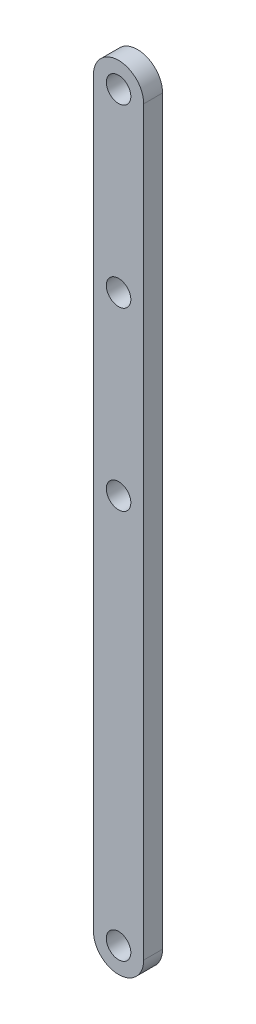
ISO-10303-21;
HEADER;
FILE_DESCRIPTION(('STEP AP214'),'2;1');
FILE_NAME('part.step','',(''),(''),'','','');
FILE_SCHEMA(('AUTOMOTIVE_DESIGN { 1 0 10303 214 1 1 1 1 }'));
ENDSEC;
DATA;
#1=APPLICATION_CONTEXT('core data for automotive mechanical design processes');
#2=APPLICATION_PROTOCOL_DEFINITION('international standard','automotive_design',2000,#1);
#3=PRODUCT_CONTEXT('',#1,'mechanical');
#4=PRODUCT('Part','Part','',(#3));
#5=PRODUCT_RELATED_PRODUCT_CATEGORY('part','',(#4));
#6=PRODUCT_DEFINITION_FORMATION('','',#4);
#7=PRODUCT_DEFINITION_CONTEXT('part definition',#1,'design');
#8=PRODUCT_DEFINITION('design','',#6,#7);
#9=PRODUCT_DEFINITION_SHAPE('','',#8);
#10=(LENGTH_UNIT() NAMED_UNIT(*) SI_UNIT(.MILLI.,.METRE.));
#11=(NAMED_UNIT(*) PLANE_ANGLE_UNIT() SI_UNIT($,.RADIAN.));
#12=(NAMED_UNIT(*) SI_UNIT($,.STERADIAN.) SOLID_ANGLE_UNIT());
#13=UNCERTAINTY_MEASURE_WITH_UNIT(LENGTH_MEASURE(1.E-05),#10,'distance_accuracy_value','');
#14=(GEOMETRIC_REPRESENTATION_CONTEXT(3) GLOBAL_UNCERTAINTY_ASSIGNED_CONTEXT((#13)) GLOBAL_UNIT_ASSIGNED_CONTEXT((#10,
#11,#12)) REPRESENTATION_CONTEXT('',''));
#15=CARTESIAN_POINT('',(0.,0.,0.));
#16=DIRECTION('',(0.,0.,1.));
#17=DIRECTION('',(1.,0.,0.));
#18=AXIS2_PLACEMENT_3D('',#15,#16,#17);
#19=CARTESIAN_POINT('',(0.,0.,3.));
#20=DIRECTION('',(0.,0.,-1.));
#21=DIRECTION('',(-1.,0.,0.));
#22=AXIS2_PLACEMENT_3D('',#19,#20,#21);
#23=CYLINDRICAL_SURFACE('',#22,4.);
#24=CARTESIAN_POINT('',(0.,0.,0.));
#25=DIRECTION('',(0.,0.,1.));
#26=DIRECTION('',(1.,0.,0.));
#27=AXIS2_PLACEMENT_3D('',#24,#25,#26);
#28=CIRCLE('',#27,4.);
#29=CARTESIAN_POINT('',(-4.,0.,0.));
#30=VERTEX_POINT('',#29);
#31=CARTESIAN_POINT('',(4.,0.,0.));
#32=VERTEX_POINT('',#31);
#33=EDGE_CURVE('E98',#30,#32,#28,.T.);
#34=ORIENTED_EDGE('',*,*,#33,.T.);
#35=DIRECTION('',(0.,0.,-1.));
#36=VECTOR('',#35,1.);
#37=CARTESIAN_POINT('',(4.,0.,3.));
#38=LINE('',#37,#36);
#39=CARTESIAN_POINT('',(4.,0.,3.));
#40=VERTEX_POINT('',#39);
#41=EDGE_CURVE('E11',#40,#32,#38,.T.);
#42=ORIENTED_EDGE('',*,*,#41,.F.);
#43=CARTESIAN_POINT('',(0.,0.,3.));
#44=DIRECTION('',(0.,0.,1.));
#45=DIRECTION('',(1.,0.,0.));
#46=AXIS2_PLACEMENT_3D('',#43,#44,#45);
#47=CIRCLE('',#46,4.);
#48=CARTESIAN_POINT('',(-4.,0.,3.));
#49=VERTEX_POINT('',#48);
#50=EDGE_CURVE('E86',#49,#40,#47,.T.);
#51=ORIENTED_EDGE('',*,*,#50,.F.);
#52=DIRECTION('',(0.,0.,-1.));
#53=VECTOR('',#52,1.);
#54=CARTESIAN_POINT('',(-4.,0.,3.));
#55=LINE('',#54,#53);
#56=EDGE_CURVE('E94',#49,#30,#55,.T.);
#57=ORIENTED_EDGE('',*,*,#56,.T.);
#58=EDGE_LOOP('',(#34,#42,#51,#57));
#59=FACE_BOUND('',#58,.T.);
#60=ADVANCED_FACE('F35',(#59),#23,.T.);
#61=CARTESIAN_POINT('',(4.,0.,3.));
#62=DIRECTION('',(-1.,0.,0.));
#63=DIRECTION('',(0.,0.,1.));
#64=AXIS2_PLACEMENT_3D('',#61,#62,#63);
#65=PLANE('',#64);
#66=DIRECTION('',(0.,1.,0.));
#67=VECTOR('',#66,1.);
#68=CARTESIAN_POINT('',(4.,0.,0.));
#69=LINE('',#68,#67);
#70=CARTESIAN_POINT('',(4.,118.,0.));
#71=VERTEX_POINT('',#70);
#72=EDGE_CURVE('E90',#32,#71,#69,.T.);
#73=ORIENTED_EDGE('',*,*,#72,.T.);
#74=DIRECTION('',(0.,0.,-1.));
#75=VECTOR('',#74,1.);
#76=CARTESIAN_POINT('',(4.,118.,3.));
#77=LINE('',#76,#75);
#78=CARTESIAN_POINT('',(4.,118.,3.));
#79=VERTEX_POINT('',#78);
#80=EDGE_CURVE('E43',#79,#71,#77,.T.);
#81=ORIENTED_EDGE('',*,*,#80,.F.);
#82=DIRECTION('',(0.,1.,0.));
#83=VECTOR('',#82,1.);
#84=CARTESIAN_POINT('',(4.,0.,3.));
#85=LINE('',#84,#83);
#86=EDGE_CURVE('E81',#40,#79,#85,.T.);
#87=ORIENTED_EDGE('',*,*,#86,.F.);
#88=ORIENTED_EDGE('',*,*,#41,.T.);
#89=EDGE_LOOP('',(#73,#81,#87,#88));
#90=FACE_BOUND('',#89,.T.);
#91=ADVANCED_FACE('F89',(#90),#65,.F.);
#92=CARTESIAN_POINT('',(0.,118.,3.));
#93=DIRECTION('',(0.,0.,-1.));
#94=DIRECTION('',(-1.,0.,0.));
#95=AXIS2_PLACEMENT_3D('',#92,#93,#94);
#96=CYLINDRICAL_SURFACE('',#95,4.);
#97=CARTESIAN_POINT('',(0.,118.,0.));
#98=DIRECTION('',(0.,0.,1.));
#99=DIRECTION('',(1.,0.,0.));
#100=AXIS2_PLACEMENT_3D('',#97,#98,#99);
#101=CIRCLE('',#100,4.);
#102=CARTESIAN_POINT('',(-4.,118.,0.));
#103=VERTEX_POINT('',#102);
#104=EDGE_CURVE('E68',#71,#103,#101,.T.);
#105=ORIENTED_EDGE('',*,*,#104,.T.);
#106=DIRECTION('',(0.,0.,-1.));
#107=VECTOR('',#106,1.);
#108=CARTESIAN_POINT('',(-4.,118.,3.));
#109=LINE('',#108,#107);
#110=CARTESIAN_POINT('',(-4.,118.,3.));
#111=VERTEX_POINT('',#110);
#112=EDGE_CURVE('E91',#111,#103,#109,.T.);
#113=ORIENTED_EDGE('',*,*,#112,.F.);
#114=CARTESIAN_POINT('',(0.,118.,3.));
#115=DIRECTION('',(0.,0.,1.));
#116=DIRECTION('',(1.,0.,0.));
#117=AXIS2_PLACEMENT_3D('',#114,#115,#116);
#118=CIRCLE('',#117,4.);
#119=EDGE_CURVE('E84',#79,#111,#118,.T.);
#120=ORIENTED_EDGE('',*,*,#119,.F.);
#121=ORIENTED_EDGE('',*,*,#80,.T.);
#122=EDGE_LOOP('',(#105,#113,#120,#121));
#123=FACE_BOUND('',#122,.T.);
#124=ADVANCED_FACE('F92',(#123),#96,.T.);
#125=CARTESIAN_POINT('',(-4.,0.,3.));
#126=DIRECTION('',(1.,0.,0.));
#127=DIRECTION('',(0.,0.,-1.));
#128=AXIS2_PLACEMENT_3D('',#125,#126,#127);
#129=PLANE('',#128);
#130=DIRECTION('',(0.,-1.,0.));
#131=VECTOR('',#130,1.);
#132=CARTESIAN_POINT('',(-4.,0.,0.));
#133=LINE('',#132,#131);
#134=EDGE_CURVE('E74',#103,#30,#133,.T.);
#135=ORIENTED_EDGE('',*,*,#134,.T.);
#136=ORIENTED_EDGE('',*,*,#56,.F.);
#137=DIRECTION('',(0.,-1.,0.));
#138=VECTOR('',#137,1.);
#139=CARTESIAN_POINT('',(-4.,0.,3.));
#140=LINE('',#139,#138);
#141=EDGE_CURVE('E51',#111,#49,#140,.T.);
#142=ORIENTED_EDGE('',*,*,#141,.F.);
#143=ORIENTED_EDGE('',*,*,#112,.T.);
#144=EDGE_LOOP('',(#135,#136,#142,#143));
#145=FACE_BOUND('',#144,.T.);
#146=ADVANCED_FACE('F106',(#145),#129,.F.);
#147=CARTESIAN_POINT('',(0.,0.,3.));
#148=DIRECTION('',(0.,0.,1.));
#149=DIRECTION('',(1.,0.,0.));
#150=AXIS2_PLACEMENT_3D('',#147,#148,#149);
#151=PLANE('',#150);
#152=CARTESIAN_POINT('',(0.,118.,3.));
#153=DIRECTION('',(0.,0.,1.));
#154=DIRECTION('',(1.,0.,0.));
#155=AXIS2_PLACEMENT_3D('',#152,#153,#154);
#156=CIRCLE('',#155,1.95);
#157=CARTESIAN_POINT('',(1.95,118.,3.));
#158=VERTEX_POINT('',#157);
#159=EDGE_CURVE('E132',#158,#158,#156,.T.);
#160=ORIENTED_EDGE('',*,*,#159,.F.);
#161=EDGE_LOOP('',(#160));
#162=FACE_BOUND('',#161,.T.);
#163=CARTESIAN_POINT('',(0.,0.,3.));
#164=DIRECTION('',(0.,0.,1.));
#165=DIRECTION('',(1.,0.,0.));
#166=AXIS2_PLACEMENT_3D('',#163,#164,#165);
#167=CIRCLE('',#166,1.95);
#168=CARTESIAN_POINT('',(1.95,0.,3.));
#169=VERTEX_POINT('',#168);
#170=EDGE_CURVE('E126',#169,#169,#167,.T.);
#171=ORIENTED_EDGE('',*,*,#170,.F.);
#172=EDGE_LOOP('',(#171));
#173=FACE_BOUND('',#172,.T.);
#174=CARTESIAN_POINT('',(0.,62.,3.));
#175=DIRECTION('',(0.,0.,1.));
#176=DIRECTION('',(1.,0.,0.));
#177=AXIS2_PLACEMENT_3D('',#174,#175,#176);
#178=CIRCLE('',#177,1.95);
#179=CARTESIAN_POINT('',(1.95,62.,3.));
#180=VERTEX_POINT('',#179);
#181=EDGE_CURVE('E120',#180,#180,#178,.T.);
#182=ORIENTED_EDGE('',*,*,#181,.F.);
#183=EDGE_LOOP('',(#182));
#184=FACE_BOUND('',#183,.T.);
#185=CARTESIAN_POINT('',(0.,90.,3.));
#186=DIRECTION('',(0.,0.,1.));
#187=DIRECTION('',(1.,0.,0.));
#188=AXIS2_PLACEMENT_3D('',#185,#186,#187);
#189=CIRCLE('',#188,1.95);
#190=CARTESIAN_POINT('',(1.95,90.,3.));
#191=VERTEX_POINT('',#190);
#192=EDGE_CURVE('E114',#191,#191,#189,.T.);
#193=ORIENTED_EDGE('',*,*,#192,.F.);
#194=EDGE_LOOP('',(#193));
#195=FACE_BOUND('',#194,.T.);
#196=ORIENTED_EDGE('',*,*,#50,.T.);
#197=ORIENTED_EDGE('',*,*,#86,.T.);
#198=ORIENTED_EDGE('',*,*,#119,.T.);
#199=ORIENTED_EDGE('',*,*,#141,.T.);
#200=EDGE_LOOP('',(#196,#197,#198,#199));
#201=FACE_BOUND('',#200,.T.);
#202=ADVANCED_FACE('F82',(#162,#173,#184,#195,#201),#151,.T.);
#203=CARTESIAN_POINT('',(0.,0.,0.));
#204=DIRECTION('',(0.,0.,1.));
#205=DIRECTION('',(1.,0.,0.));
#206=AXIS2_PLACEMENT_3D('',#203,#204,#205);
#207=PLANE('',#206);
#208=CARTESIAN_POINT('',(0.,118.,0.));
#209=DIRECTION('',(0.,0.,1.));
#210=DIRECTION('',(1.,0.,0.));
#211=AXIS2_PLACEMENT_3D('',#208,#209,#210);
#212=CIRCLE('',#211,1.95);
#213=CARTESIAN_POINT('',(1.95,118.,0.));
#214=VERTEX_POINT('',#213);
#215=EDGE_CURVE('E129',#214,#214,#212,.T.);
#216=ORIENTED_EDGE('',*,*,#215,.T.);
#217=EDGE_LOOP('',(#216));
#218=FACE_BOUND('',#217,.T.);
#219=CARTESIAN_POINT('',(0.,0.,0.));
#220=DIRECTION('',(0.,0.,1.));
#221=DIRECTION('',(1.,0.,0.));
#222=AXIS2_PLACEMENT_3D('',#219,#220,#221);
#223=CIRCLE('',#222,1.95);
#224=CARTESIAN_POINT('',(1.95,0.,0.));
#225=VERTEX_POINT('',#224);
#226=EDGE_CURVE('E123',#225,#225,#223,.T.);
#227=ORIENTED_EDGE('',*,*,#226,.T.);
#228=EDGE_LOOP('',(#227));
#229=FACE_BOUND('',#228,.T.);
#230=CARTESIAN_POINT('',(0.,62.,0.));
#231=DIRECTION('',(0.,0.,1.));
#232=DIRECTION('',(1.,0.,0.));
#233=AXIS2_PLACEMENT_3D('',#230,#231,#232);
#234=CIRCLE('',#233,1.95);
#235=CARTESIAN_POINT('',(1.95,62.,0.));
#236=VERTEX_POINT('',#235);
#237=EDGE_CURVE('E117',#236,#236,#234,.T.);
#238=ORIENTED_EDGE('',*,*,#237,.T.);
#239=EDGE_LOOP('',(#238));
#240=FACE_BOUND('',#239,.T.);
#241=CARTESIAN_POINT('',(0.,90.,0.));
#242=DIRECTION('',(0.,0.,1.));
#243=DIRECTION('',(1.,0.,0.));
#244=AXIS2_PLACEMENT_3D('',#241,#242,#243);
#245=CIRCLE('',#244,1.95);
#246=CARTESIAN_POINT('',(1.95,90.,0.));
#247=VERTEX_POINT('',#246);
#248=EDGE_CURVE('E101',#247,#247,#245,.T.);
#249=ORIENTED_EDGE('',*,*,#248,.T.);
#250=EDGE_LOOP('',(#249));
#251=FACE_BOUND('',#250,.T.);
#252=ORIENTED_EDGE('',*,*,#33,.F.);
#253=ORIENTED_EDGE('',*,*,#134,.F.);
#254=ORIENTED_EDGE('',*,*,#104,.F.);
#255=ORIENTED_EDGE('',*,*,#72,.F.);
#256=EDGE_LOOP('',(#252,#253,#254,#255));
#257=FACE_BOUND('',#256,.T.);
#258=ADVANCED_FACE('F109',(#218,#229,#240,#251,#257),#207,.F.);
#259=CARTESIAN_POINT('',(0.,90.,3.));
#260=DIRECTION('',(0.,0.,1.));
#261=DIRECTION('',(1.,0.,0.));
#262=AXIS2_PLACEMENT_3D('',#259,#260,#261);
#263=CYLINDRICAL_SURFACE('',#262,1.95);
#264=ORIENTED_EDGE('',*,*,#248,.F.);
#265=EDGE_LOOP('',(#264));
#266=FACE_BOUND('',#265,.T.);
#267=ORIENTED_EDGE('',*,*,#192,.T.);
#268=EDGE_LOOP('',(#267));
#269=FACE_BOUND('',#268,.T.);
#270=ADVANCED_FACE('F147',(#266,#269),#263,.F.);
#271=CARTESIAN_POINT('',(0.,62.,3.));
#272=DIRECTION('',(0.,0.,1.));
#273=DIRECTION('',(1.,0.,0.));
#274=AXIS2_PLACEMENT_3D('',#271,#272,#273);
#275=CYLINDRICAL_SURFACE('',#274,1.95);
#276=ORIENTED_EDGE('',*,*,#237,.F.);
#277=EDGE_LOOP('',(#276));
#278=FACE_BOUND('',#277,.T.);
#279=ORIENTED_EDGE('',*,*,#181,.T.);
#280=EDGE_LOOP('',(#279));
#281=FACE_BOUND('',#280,.T.);
#282=ADVANCED_FACE('F149',(#278,#281),#275,.F.);
#283=CARTESIAN_POINT('',(0.,0.,3.));
#284=DIRECTION('',(0.,0.,1.));
#285=DIRECTION('',(1.,0.,0.));
#286=AXIS2_PLACEMENT_3D('',#283,#284,#285);
#287=CYLINDRICAL_SURFACE('',#286,1.95);
#288=ORIENTED_EDGE('',*,*,#226,.F.);
#289=EDGE_LOOP('',(#288));
#290=FACE_BOUND('',#289,.T.);
#291=ORIENTED_EDGE('',*,*,#170,.T.);
#292=EDGE_LOOP('',(#291));
#293=FACE_BOUND('',#292,.T.);
#294=ADVANCED_FACE('F156',(#290,#293),#287,.F.);
#295=CARTESIAN_POINT('',(0.,118.,3.));
#296=DIRECTION('',(0.,0.,1.));
#297=DIRECTION('',(1.,0.,0.));
#298=AXIS2_PLACEMENT_3D('',#295,#296,#297);
#299=CYLINDRICAL_SURFACE('',#298,1.95);
#300=ORIENTED_EDGE('',*,*,#215,.F.);
#301=EDGE_LOOP('',(#300));
#302=FACE_BOUND('',#301,.T.);
#303=ORIENTED_EDGE('',*,*,#159,.T.);
#304=EDGE_LOOP('',(#303));
#305=FACE_BOUND('',#304,.T.);
#306=ADVANCED_FACE('F136',(#302,#305),#299,.F.);
#307=CLOSED_SHELL('',(#60,#91,#124,#146,#202,#258,#270,#282,#294,#306));
#308=MANIFOLD_SOLID_BREP('B2',#307);
#309=ADVANCED_BREP_SHAPE_REPRESENTATION('',(#18,#308),#14);
#310=SHAPE_DEFINITION_REPRESENTATION(#9,#309);
ENDSEC;
END-ISO-10303-21;
